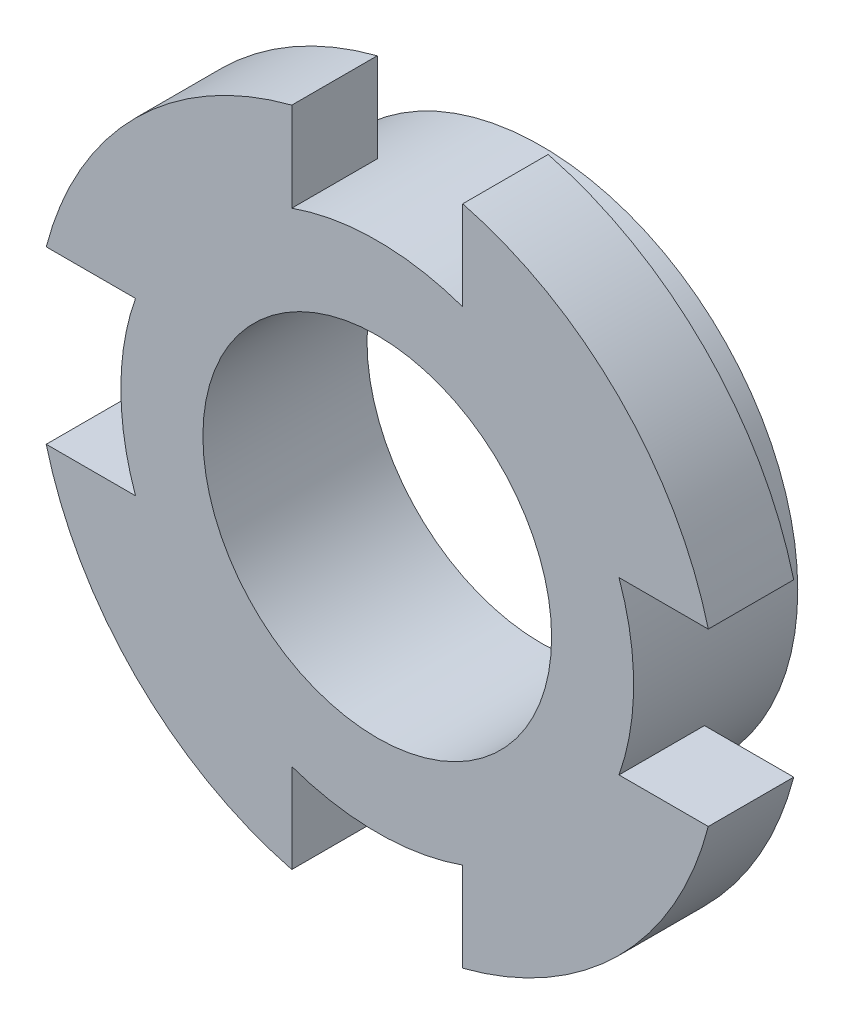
from build123d import *

# Parameters (mm, degrees)
SKETCH1_R           = 4.7625
BASE_EXTRUDE_DEPTH  = 11.1125
SKETCH2_R           = 6.35
BOSS_EXTRUDE1_DEPTH = 1.5875
SKETCH3_R           = 3.2385
CUT_EXTRUDE2_DEPTH  = 16.55426
SKETCH4_R           = 6.788927
CUT_EXTRUDE3_DEPTH  = 9.652
SKETCH5_R           = 7.62225
CUT_EXTRUDE4_DEPTH  = 10.483423


with BuildPart() as part:
    # Sketch1 → Base-Extrude (new body)
    with BuildSketch(Plane.XY):
        with Locations(Location((0, 0, 0), (0, 0, 180))):
            Circle(SKETCH1_R)
    extrude(amount=BASE_EXTRUDE_DEPTH)

    # Sketch2 → Boss-Extrude1 (add)
    with BuildSketch(Plane.XY.offset(11.1125)):
        Circle(SKETCH2_R)
    extrude(amount=BOSS_EXTRUDE1_DEPTH)

    # Sketch3 → Cut-Extrude2 (cut, through all)
    with BuildSketch(Plane.XY.offset(12.7)):
        Circle(SKETCH3_R)
    extrude(amount=-CUT_EXTRUDE2_DEPTH, mode=Mode.SUBTRACT)

    # Sketch4 → Cut-Extrude3 (cut)
    with BuildSketch(Plane(origin=(0, 0, 0), x_dir=(-1, 0, 0), z_dir=(0, 0, -1))):
        Circle(SKETCH4_R)
    extrude(amount=-CUT_EXTRUDE3_DEPTH, mode=Mode.SUBTRACT)

    # Sketch5 → Cut-Extrude4 (cut, through all)
    with BuildSketch(Plane(origin=(0, 0, 9.652), x_dir=(-1, 0, 0), z_dir=(0, 0, -1))):
        Circle(SKETCH5_R)
        with BuildLine():
            Line((1.5875, 6.487938), (1.5875, 4.490128))
            ThreePointArc((1.5875, 4.490128), (0, 4.7625), (-1.5875, 4.490128))
            Line((-1.5875, 4.490128), (-1.5875, 6.487938))
            ThreePointArc((-1.5875, 6.487938), (-4.723002, 4.723002), (-6.487938, 1.5875))
            Line((-6.487938, 1.5875), (-4.490128, 1.5875))
            ThreePointArc((-4.490128, 1.5875), (-4.7625, 0), (-4.490128, -1.5875))
            Line((-4.490128, -1.5875), (-6.487938, -1.5875))
            ThreePointArc((-6.487938, -1.5875), (-4.723002, -4.723002), (-1.5875, -6.487938))
            Line((-1.5875, -6.487938), (-1.5875, -4.490128))
            ThreePointArc((-1.5875, -4.490128), (0, -4.7625), (1.5875, -4.490128))
            Line((1.5875, -4.490128), (1.5875, -6.487938))
            ThreePointArc((1.5875, -6.487938), (4.723002, -4.723002), (6.487938, -1.5875))
            Line((6.487938, -1.5875), (4.490128, -1.5875))
            ThreePointArc((4.490128, -1.5875), (4.7625, 0), (4.490128, 1.5875))
            Line((4.490128, 1.5875), (6.487938, 1.5875))
            ThreePointArc((6.487938, 1.5875), (4.723002, 4.723002), (1.5875, 6.487938))
        make_face(mode=Mode.SUBTRACT)
    extrude(amount=-CUT_EXTRUDE4_DEPTH, mode=Mode.SUBTRACT)


solid = part.part
